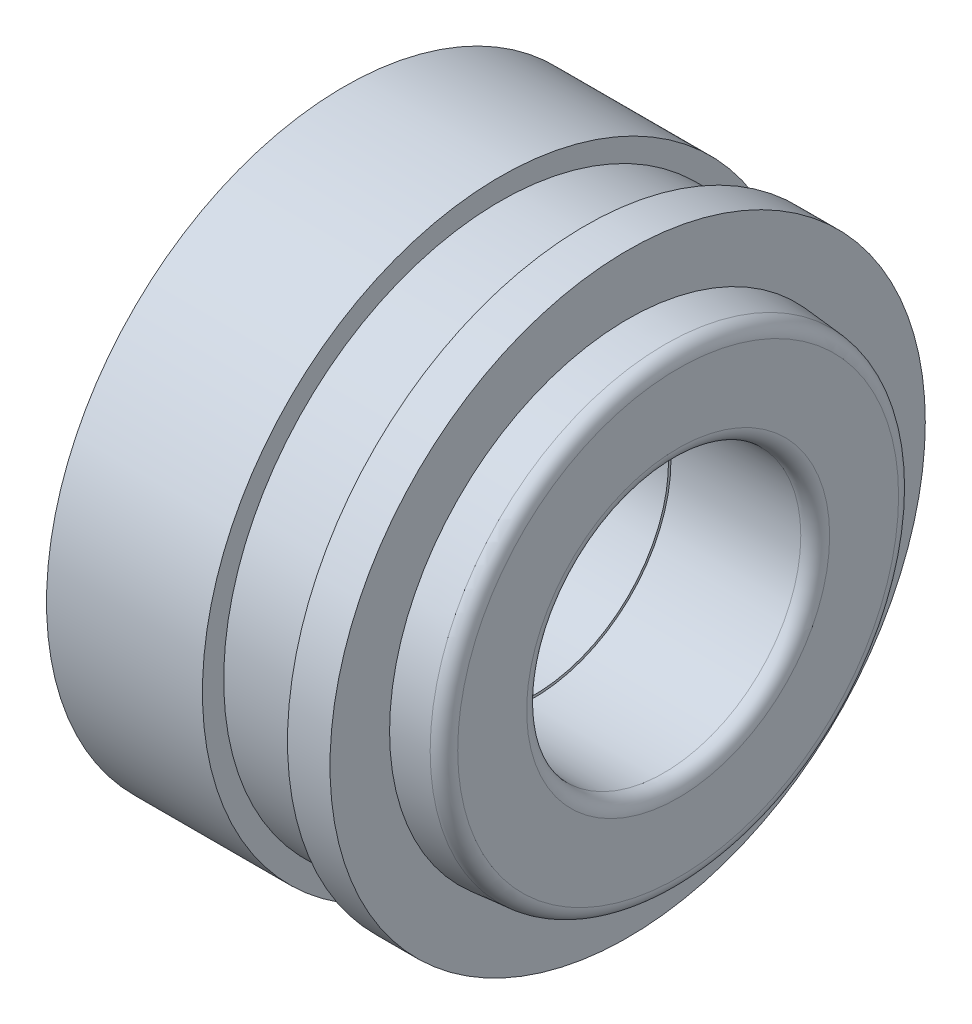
ISO-10303-21;
HEADER;
FILE_DESCRIPTION(('STEP AP214'),'2;1');
FILE_NAME('part.step','',(''),(''),'','','');
FILE_SCHEMA(('AUTOMOTIVE_DESIGN { 1 0 10303 214 1 1 1 1 }'));
ENDSEC;
DATA;
#1=APPLICATION_CONTEXT('core data for automotive mechanical design processes');
#2=APPLICATION_PROTOCOL_DEFINITION('international standard','automotive_design',2000,#1);
#3=PRODUCT_CONTEXT('',#1,'mechanical');
#4=PRODUCT('Part','Part','',(#3));
#5=PRODUCT_RELATED_PRODUCT_CATEGORY('part','',(#4));
#6=PRODUCT_DEFINITION_FORMATION('','',#4);
#7=PRODUCT_DEFINITION_CONTEXT('part definition',#1,'design');
#8=PRODUCT_DEFINITION('design','',#6,#7);
#9=PRODUCT_DEFINITION_SHAPE('','',#8);
#10=(LENGTH_UNIT() NAMED_UNIT(*) SI_UNIT(.MILLI.,.METRE.));
#11=(NAMED_UNIT(*) PLANE_ANGLE_UNIT() SI_UNIT($,.RADIAN.));
#12=(NAMED_UNIT(*) SI_UNIT($,.STERADIAN.) SOLID_ANGLE_UNIT());
#13=UNCERTAINTY_MEASURE_WITH_UNIT(LENGTH_MEASURE(1.E-05),#10,'distance_accuracy_value','');
#14=(GEOMETRIC_REPRESENTATION_CONTEXT(3) GLOBAL_UNCERTAINTY_ASSIGNED_CONTEXT((#13)) GLOBAL_UNIT_ASSIGNED_CONTEXT((#10,
#11,#12)) REPRESENTATION_CONTEXT('',''));
#15=CARTESIAN_POINT('',(0.,0.,0.));
#16=DIRECTION('',(0.,0.,1.));
#17=DIRECTION('',(1.,0.,0.));
#18=AXIS2_PLACEMENT_3D('',#15,#16,#17);
#19=CARTESIAN_POINT('',(-13.5,0.,0.));
#20=DIRECTION('',(1.,0.,0.));
#21=DIRECTION('',(0.,0.,-1.));
#22=AXIS2_PLACEMENT_3D('',#19,#20,#21);
#23=CYLINDRICAL_SURFACE('',#22,9.5);
#24=CARTESIAN_POINT('',(-7.5,0.,0.));
#25=DIRECTION('',(-1.,0.,0.));
#26=DIRECTION('',(0.,0.,1.));
#27=AXIS2_PLACEMENT_3D('',#24,#25,#26);
#28=CIRCLE('',#27,9.5);
#29=CARTESIAN_POINT('',(-7.5,0.,9.5));
#30=VERTEX_POINT('',#29);
#31=EDGE_CURVE('E90',#30,#30,#28,.F.);
#32=ORIENTED_EDGE('',*,*,#31,.F.);
#33=EDGE_LOOP('',(#32));
#34=FACE_BOUND('',#33,.T.);
#35=CARTESIAN_POINT('',(-0.116999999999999,0.,0.));
#36=DIRECTION('',(1.,0.,0.));
#37=DIRECTION('',(0.,1.,0.));
#38=AXIS2_PLACEMENT_3D('',#35,#36,#37);
#39=CIRCLE('',#38,9.5);
#40=CARTESIAN_POINT('',(-0.116999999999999,9.5,0.));
#41=VERTEX_POINT('',#40);
#42=EDGE_CURVE('E78',#41,#41,#39,.F.);
#43=ORIENTED_EDGE('',*,*,#42,.F.);
#44=EDGE_LOOP('',(#43));
#45=FACE_BOUND('',#44,.T.);
#46=ADVANCED_FACE('F74',(#34,#45),#23,.F.);
#47=CARTESIAN_POINT('',(-13.5,21.,0.));
#48=DIRECTION('',(-1.,0.,0.));
#49=DIRECTION('',(0.,0.,1.));
#50=AXIS2_PLACEMENT_3D('',#47,#48,#49);
#51=PLANE('',#50);
#52=CARTESIAN_POINT('',(-13.5,0.,0.));
#53=DIRECTION('',(-1.,0.,0.));
#54=DIRECTION('',(0.,0.,1.));
#55=AXIS2_PLACEMENT_3D('',#52,#53,#54);
#56=CIRCLE('',#55,10.25);
#57=CARTESIAN_POINT('',(-13.5,0.,10.25));
#58=VERTEX_POINT('',#57);
#59=EDGE_CURVE('E100',#58,#58,#56,.T.);
#60=ORIENTED_EDGE('',*,*,#59,.F.);
#61=EDGE_LOOP('',(#60));
#62=FACE_BOUND('',#61,.T.);
#63=CARTESIAN_POINT('',(-13.5,0.,0.));
#64=DIRECTION('',(1.,0.,0.));
#65=DIRECTION('',(0.,0.,-1.));
#66=AXIS2_PLACEMENT_3D('',#63,#64,#65);
#67=CIRCLE('',#66,21.);
#68=CARTESIAN_POINT('',(-13.5,0.,-21.));
#69=VERTEX_POINT('',#68);
#70=EDGE_CURVE('E11',#69,#69,#67,.T.);
#71=ORIENTED_EDGE('',*,*,#70,.F.);
#72=EDGE_LOOP('',(#71));
#73=FACE_BOUND('',#72,.T.);
#74=ADVANCED_FACE('F76',(#62,#73),#51,.T.);
#75=CARTESIAN_POINT('',(35.4425685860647,0.,0.));
#76=DIRECTION('',(1.,0.,0.));
#77=DIRECTION('',(0.,0.,-1.));
#78=AXIS2_PLACEMENT_3D('',#75,#76,#77);
#79=CYLINDRICAL_SURFACE('',#78,21.);
#80=ORIENTED_EDGE('',*,*,#70,.T.);
#81=EDGE_LOOP('',(#80));
#82=FACE_BOUND('',#81,.T.);
#83=CARTESIAN_POINT('',(-2.5,0.,0.));
#84=DIRECTION('',(1.,0.,0.));
#85=DIRECTION('',(0.,0.,-1.));
#86=AXIS2_PLACEMENT_3D('',#83,#84,#85);
#87=CIRCLE('',#86,21.);
#88=CARTESIAN_POINT('',(-2.5,0.,-21.));
#89=VERTEX_POINT('',#88);
#90=EDGE_CURVE('E82',#89,#89,#87,.T.);
#91=ORIENTED_EDGE('',*,*,#90,.F.);
#92=EDGE_LOOP('',(#91));
#93=FACE_BOUND('',#92,.T.);
#94=ADVANCED_FACE('F122',(#82,#93),#79,.T.);
#95=CARTESIAN_POINT('',(-2.5,19.5,0.));
#96=DIRECTION('',(1.,0.,0.));
#97=DIRECTION('',(0.,0.,-1.));
#98=AXIS2_PLACEMENT_3D('',#95,#96,#97);
#99=PLANE('',#98);
#100=ORIENTED_EDGE('',*,*,#90,.T.);
#101=EDGE_LOOP('',(#100));
#102=FACE_BOUND('',#101,.T.);
#103=CARTESIAN_POINT('',(-2.5,0.,0.));
#104=DIRECTION('',(1.,0.,0.));
#105=DIRECTION('',(0.,0.,-1.));
#106=AXIS2_PLACEMENT_3D('',#103,#104,#105);
#107=CIRCLE('',#106,19.5);
#108=CARTESIAN_POINT('',(-2.5,0.,-19.5));
#109=VERTEX_POINT('',#108);
#110=EDGE_CURVE('E87',#109,#109,#107,.T.);
#111=ORIENTED_EDGE('',*,*,#110,.F.);
#112=EDGE_LOOP('',(#111));
#113=FACE_BOUND('',#112,.T.);
#114=ADVANCED_FACE('F120',(#102,#113),#99,.T.);
#115=CARTESIAN_POINT('',(35.4425685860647,0.,0.));
#116=DIRECTION('',(1.,0.,0.));
#117=DIRECTION('',(0.,0.,-1.));
#118=AXIS2_PLACEMENT_3D('',#115,#116,#117);
#119=CYLINDRICAL_SURFACE('',#118,19.5);
#120=ORIENTED_EDGE('',*,*,#110,.T.);
#121=EDGE_LOOP('',(#120));
#122=FACE_BOUND('',#121,.T.);
#123=CARTESIAN_POINT('',(3.5,0.,0.));
#124=DIRECTION('',(1.,0.,0.));
#125=DIRECTION('',(0.,0.,-1.));
#126=AXIS2_PLACEMENT_3D('',#123,#124,#125);
#127=CIRCLE('',#126,19.5);
#128=CARTESIAN_POINT('',(3.5,0.,-19.5));
#129=VERTEX_POINT('',#128);
#130=EDGE_CURVE('E112',#129,#129,#127,.T.);
#131=ORIENTED_EDGE('',*,*,#130,.F.);
#132=EDGE_LOOP('',(#131));
#133=FACE_BOUND('',#132,.T.);
#134=ADVANCED_FACE('F117',(#122,#133),#119,.T.);
#135=CARTESIAN_POINT('',(3.5,21.,0.));
#136=DIRECTION('',(-1.,0.,0.));
#137=DIRECTION('',(0.,0.,1.));
#138=AXIS2_PLACEMENT_3D('',#135,#136,#137);
#139=PLANE('',#138);
#140=ORIENTED_EDGE('',*,*,#130,.T.);
#141=EDGE_LOOP('',(#140));
#142=FACE_BOUND('',#141,.T.);
#143=CARTESIAN_POINT('',(3.5,0.,0.));
#144=DIRECTION('',(1.,0.,0.));
#145=DIRECTION('',(0.,0.,-1.));
#146=AXIS2_PLACEMENT_3D('',#143,#144,#145);
#147=CIRCLE('',#146,21.);
#148=CARTESIAN_POINT('',(3.5,0.,-21.));
#149=VERTEX_POINT('',#148);
#150=EDGE_CURVE('E97',#149,#149,#147,.T.);
#151=ORIENTED_EDGE('',*,*,#150,.F.);
#152=EDGE_LOOP('',(#151));
#153=FACE_BOUND('',#152,.T.);
#154=ADVANCED_FACE('F129',(#142,#153),#139,.T.);
#155=CARTESIAN_POINT('',(35.4425685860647,0.,0.));
#156=DIRECTION('',(1.,0.,0.));
#157=DIRECTION('',(0.,0.,-1.));
#158=AXIS2_PLACEMENT_3D('',#155,#156,#157);
#159=CYLINDRICAL_SURFACE('',#158,21.);
#160=ORIENTED_EDGE('',*,*,#150,.T.);
#161=EDGE_LOOP('',(#160));
#162=FACE_BOUND('',#161,.T.);
#163=CARTESIAN_POINT('',(6.5,0.,0.));
#164=DIRECTION('',(1.,0.,0.));
#165=DIRECTION('',(0.,0.,-1.));
#166=AXIS2_PLACEMENT_3D('',#163,#164,#165);
#167=CIRCLE('',#166,21.);
#168=CARTESIAN_POINT('',(6.5,0.,-21.));
#169=VERTEX_POINT('',#168);
#170=EDGE_CURVE('E92',#169,#169,#167,.T.);
#171=ORIENTED_EDGE('',*,*,#170,.F.);
#172=EDGE_LOOP('',(#171));
#173=FACE_BOUND('',#172,.T.);
#174=ADVANCED_FACE('F147',(#162,#173),#159,.T.);
#175=CARTESIAN_POINT('',(6.5,21.,0.));
#176=DIRECTION('',(1.,0.,0.));
#177=DIRECTION('',(0.,0.,-1.));
#178=AXIS2_PLACEMENT_3D('',#175,#176,#177);
#179=PLANE('',#178);
#180=CARTESIAN_POINT('',(6.5,0.,0.));
#181=DIRECTION('',(-1.,0.,0.));
#182=DIRECTION('',(0.,0.,1.));
#183=AXIS2_PLACEMENT_3D('',#180,#181,#182);
#184=CIRCLE('',#183,16.797);
#185=CARTESIAN_POINT('',(6.5,0.,16.797));
#186=VERTEX_POINT('',#185);
#187=EDGE_CURVE('E327',#186,#186,#184,.T.);
#188=ORIENTED_EDGE('',*,*,#187,.T.);
#189=EDGE_LOOP('',(#188));
#190=FACE_BOUND('',#189,.T.);
#191=ORIENTED_EDGE('',*,*,#170,.T.);
#192=EDGE_LOOP('',(#191));
#193=FACE_BOUND('',#192,.T.);
#194=ADVANCED_FACE('F143',(#190,#193),#179,.T.);
#195=CARTESIAN_POINT('',(-7.5,0.,0.));
#196=DIRECTION('',(-1.,0.,0.));
#197=DIRECTION('',(0.,0.,1.));
#198=AXIS2_PLACEMENT_3D('',#195,#196,#197);
#199=PLANE('',#198);
#200=CARTESIAN_POINT('',(-7.5,0.,0.));
#201=DIRECTION('',(-1.,0.,0.));
#202=DIRECTION('',(0.,0.,1.));
#203=AXIS2_PLACEMENT_3D('',#200,#201,#202);
#204=CIRCLE('',#203,10.25);
#205=CARTESIAN_POINT('',(-7.5,0.,10.25));
#206=VERTEX_POINT('',#205);
#207=EDGE_CURVE('E93',#206,#206,#204,.T.);
#208=ORIENTED_EDGE('',*,*,#207,.T.);
#209=EDGE_LOOP('',(#208));
#210=FACE_BOUND('',#209,.T.);
#211=ORIENTED_EDGE('',*,*,#31,.T.);
#212=EDGE_LOOP('',(#211));
#213=FACE_BOUND('',#212,.T.);
#214=ADVANCED_FACE('F146',(#210,#213),#199,.T.);
#215=CARTESIAN_POINT('',(-7.5,0.,0.));
#216=DIRECTION('',(-1.,0.,0.));
#217=DIRECTION('',(0.,0.,1.));
#218=AXIS2_PLACEMENT_3D('',#215,#216,#217);
#219=CYLINDRICAL_SURFACE('',#218,10.25);
#220=ORIENTED_EDGE('',*,*,#207,.F.);
#221=EDGE_LOOP('',(#220));
#222=FACE_BOUND('',#221,.T.);
#223=ORIENTED_EDGE('',*,*,#59,.T.);
#224=EDGE_LOOP('',(#223));
#225=FACE_BOUND('',#224,.T.);
#226=ADVANCED_FACE('F141',(#222,#225),#219,.F.);
#227=CARTESIAN_POINT('',(-0.116999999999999,-9.671,0.));
#228=DIRECTION('',(1.,0.,0.));
#229=DIRECTION('',(0.,0.,-1.));
#230=AXIS2_PLACEMENT_3D('',#227,#228,#229);
#231=PLANE('',#230);
#232=CARTESIAN_POINT('',(-0.116999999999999,0.,0.));
#233=DIRECTION('',(-1.,0.,0.));
#234=DIRECTION('',(0.,0.,1.));
#235=AXIS2_PLACEMENT_3D('',#232,#233,#234);
#236=CIRCLE('',#235,9.671);
#237=CARTESIAN_POINT('',(-0.116999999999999,0.,9.67100000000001));
#238=VERTEX_POINT('',#237);
#239=EDGE_CURVE('E330',#238,#238,#236,.T.);
#240=ORIENTED_EDGE('',*,*,#239,.F.);
#241=EDGE_LOOP('',(#240));
#242=FACE_BOUND('',#241,.T.);
#243=ORIENTED_EDGE('',*,*,#42,.T.);
#244=EDGE_LOOP('',(#243));
#245=FACE_BOUND('',#244,.T.);
#246=ADVANCED_FACE('F186',(#242,#245),#231,.T.);
#247=CARTESIAN_POINT('',(6.5,0.,0.));
#248=DIRECTION('',(-1.,0.,0.));
#249=DIRECTION('',(0.,0.,1.));
#250=AXIS2_PLACEMENT_3D('',#247,#248,#249);
#251=CONICAL_SURFACE('',#250,16.797,0.0872664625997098);
#252=CARTESIAN_POINT('',(9.13372454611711,0.,0.));
#253=DIRECTION('',(-1.,0.,0.));
#254=DIRECTION('',(0.,0.,1.));
#255=AXIS2_PLACEMENT_3D('',#252,#253,#254);
#256=CIRCLE('',#255,16.5665789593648);
#257=CARTESIAN_POINT('',(9.13372454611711,0.,16.5665789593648));
#258=VERTEX_POINT('',#257);
#259=EDGE_CURVE('E318',#258,#258,#256,.F.);
#260=ORIENTED_EDGE('',*,*,#259,.F.);
#261=EDGE_LOOP('',(#260));
#262=FACE_BOUND('',#261,.T.);
#263=ORIENTED_EDGE('',*,*,#187,.F.);
#264=EDGE_LOOP('',(#263));
#265=FACE_BOUND('',#264,.T.);
#266=ADVANCED_FACE('F192',(#262,#265),#251,.T.);
#267=CARTESIAN_POINT('',(10.063,-16.4852778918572,0.));
#268=DIRECTION('',(1.,0.,0.));
#269=DIRECTION('',(0.,0.,-1.));
#270=AXIS2_PLACEMENT_3D('',#267,#268,#269);
#271=PLANE('',#270);
#272=CARTESIAN_POINT('',(10.063,0.,0.));
#273=DIRECTION('',(1.,0.,0.));
#274=DIRECTION('',(0.,0.,-1.));
#275=AXIS2_PLACEMENT_3D('',#272,#273,#274);
#276=CIRCLE('',#275,15.5524527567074);
#277=CARTESIAN_POINT('',(10.063,0.,-15.5524527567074));
#278=VERTEX_POINT('',#277);
#279=EDGE_CURVE('E321',#278,#278,#276,.F.);
#280=ORIENTED_EDGE('',*,*,#279,.F.);
#281=EDGE_LOOP('',(#280));
#282=FACE_BOUND('',#281,.T.);
#283=CARTESIAN_POINT('',(10.063,0.,0.));
#284=DIRECTION('',(1.,0.,0.));
#285=DIRECTION('',(0.,0.,-1.));
#286=AXIS2_PLACEMENT_3D('',#283,#284,#285);
#287=CIRCLE('',#286,10.689);
#288=CARTESIAN_POINT('',(10.063,0.,-10.689));
#289=VERTEX_POINT('',#288);
#290=EDGE_CURVE('E315',#289,#289,#287,.T.);
#291=ORIENTED_EDGE('',*,*,#290,.F.);
#292=EDGE_LOOP('',(#291));
#293=FACE_BOUND('',#292,.T.);
#294=ADVANCED_FACE('F200',(#282,#293),#271,.T.);
#295=CARTESIAN_POINT('',(12.099,0.,0.));
#296=DIRECTION('',(-1.,0.,0.));
#297=DIRECTION('',(0.,0.,1.));
#298=AXIS2_PLACEMENT_3D('',#295,#296,#297);
#299=CYLINDRICAL_SURFACE('',#298,9.671);
#300=CARTESIAN_POINT('',(9.045,0.,0.));
#301=DIRECTION('',(1.,0.,0.));
#302=DIRECTION('',(0.,0.,-1.));
#303=AXIS2_PLACEMENT_3D('',#300,#301,#302);
#304=CIRCLE('',#303,9.671);
#305=CARTESIAN_POINT('',(9.045,0.,-9.67099999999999));
#306=VERTEX_POINT('',#305);
#307=EDGE_CURVE('E107',#306,#306,#304,.F.);
#308=ORIENTED_EDGE('',*,*,#307,.F.);
#309=EDGE_LOOP('',(#308));
#310=FACE_BOUND('',#309,.T.);
#311=ORIENTED_EDGE('',*,*,#239,.T.);
#312=EDGE_LOOP('',(#311));
#313=FACE_BOUND('',#312,.T.);
#314=ADVANCED_FACE('F208',(#310,#313),#299,.F.);
#315=CARTESIAN_POINT('',(9.045,0.,0.));
#316=DIRECTION('',(1.,0.,0.));
#317=DIRECTION('',(0.,0.,-1.));
#318=AXIS2_PLACEMENT_3D('',#315,#316,#317);
#319=TOROIDAL_SURFACE('',#318,15.5524527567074,1.018);
#320=ORIENTED_EDGE('',*,*,#259,.T.);
#321=EDGE_LOOP('',(#320));
#322=FACE_BOUND('',#321,.T.);
#323=ORIENTED_EDGE('',*,*,#279,.T.);
#324=EDGE_LOOP('',(#323));
#325=FACE_BOUND('',#324,.T.);
#326=ADVANCED_FACE('F216',(#322,#325),#319,.T.);
#327=CARTESIAN_POINT('',(9.045,0.,0.));
#328=DIRECTION('',(1.,0.,0.));
#329=DIRECTION('',(0.,0.,-1.));
#330=AXIS2_PLACEMENT_3D('',#327,#328,#329);
#331=TOROIDAL_SURFACE('',#330,10.689,1.018);
#332=ORIENTED_EDGE('',*,*,#290,.T.);
#333=EDGE_LOOP('',(#332));
#334=FACE_BOUND('',#333,.T.);
#335=ORIENTED_EDGE('',*,*,#307,.T.);
#336=EDGE_LOOP('',(#335));
#337=FACE_BOUND('',#336,.T.);
#338=ADVANCED_FACE('F224',(#334,#337),#331,.T.);
#339=CLOSED_SHELL('',(#46,#74,#94,#114,#134,#154,#174,#194,#214,#226,#246,#266,#294,#314,#326,#338));
#340=MANIFOLD_SOLID_BREP('B2',#339);
#341=ADVANCED_BREP_SHAPE_REPRESENTATION('',(#18,#340),#14);
#342=SHAPE_DEFINITION_REPRESENTATION(#9,#341);
ENDSEC;
END-ISO-10303-21;
